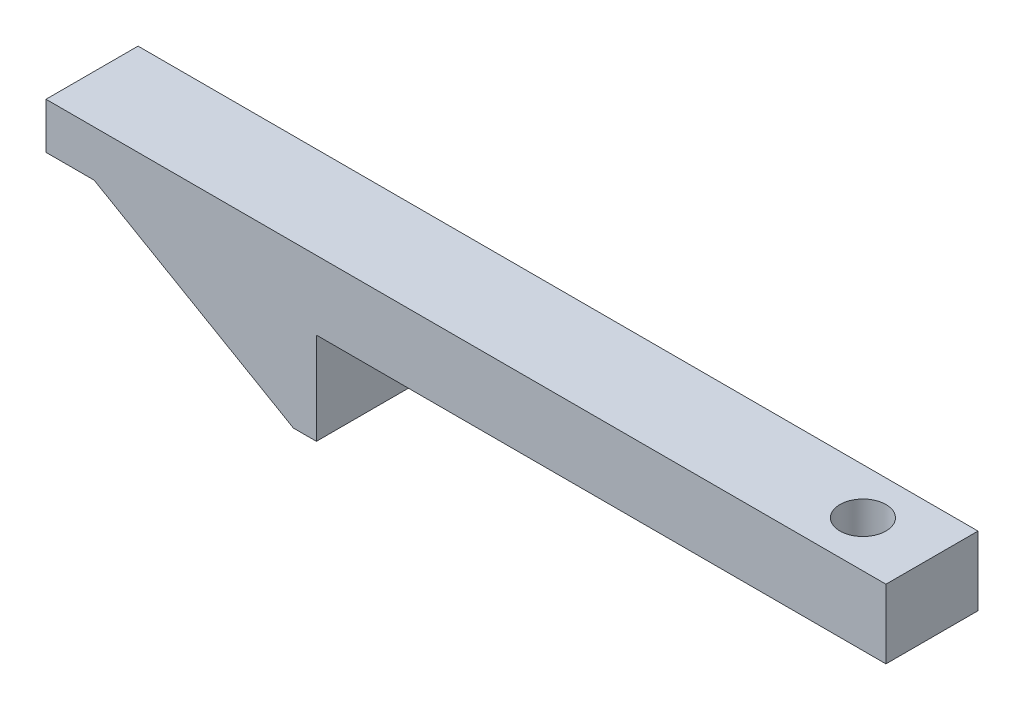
ISO-10303-21;
HEADER;
FILE_DESCRIPTION(('STEP AP214'),'2;1');
FILE_NAME('part.step','',(''),(''),'','','');
FILE_SCHEMA(('AUTOMOTIVE_DESIGN { 1 0 10303 214 1 1 1 1 }'));
ENDSEC;
DATA;
#1=APPLICATION_CONTEXT('core data for automotive mechanical design processes');
#2=APPLICATION_PROTOCOL_DEFINITION('international standard','automotive_design',2000,#1);
#3=PRODUCT_CONTEXT('',#1,'mechanical');
#4=PRODUCT('Part','Part','',(#3));
#5=PRODUCT_RELATED_PRODUCT_CATEGORY('part','',(#4));
#6=PRODUCT_DEFINITION_FORMATION('','',#4);
#7=PRODUCT_DEFINITION_CONTEXT('part definition',#1,'design');
#8=PRODUCT_DEFINITION('design','',#6,#7);
#9=PRODUCT_DEFINITION_SHAPE('','',#8);
#10=(LENGTH_UNIT() NAMED_UNIT(*) SI_UNIT(.MILLI.,.METRE.));
#11=(NAMED_UNIT(*) PLANE_ANGLE_UNIT() SI_UNIT($,.RADIAN.));
#12=(NAMED_UNIT(*) SI_UNIT($,.STERADIAN.) SOLID_ANGLE_UNIT());
#13=UNCERTAINTY_MEASURE_WITH_UNIT(LENGTH_MEASURE(1.E-05),#10,'distance_accuracy_value','');
#14=(GEOMETRIC_REPRESENTATION_CONTEXT(3) GLOBAL_UNCERTAINTY_ASSIGNED_CONTEXT((#13)) GLOBAL_UNIT_ASSIGNED_CONTEXT((#10,
#11,#12)) REPRESENTATION_CONTEXT('',''));
#15=CARTESIAN_POINT('',(0.,0.,0.));
#16=DIRECTION('',(0.,0.,1.));
#17=DIRECTION('',(1.,0.,0.));
#18=AXIS2_PLACEMENT_3D('',#15,#16,#17);
#19=CARTESIAN_POINT('',(-69.0626,-22.225,6.35));
#20=DIRECTION('',(0.,1.,0.));
#21=DIRECTION('',(-1.,0.,0.));
#22=AXIS2_PLACEMENT_3D('',#19,#20,#21);
#23=PLANE('',#22);
#24=DIRECTION('',(1.,0.,0.));
#25=VECTOR('',#24,1.);
#26=CARTESIAN_POINT('',(-69.0626,-22.225,-6.35));
#27=LINE('',#26,#25);
#28=CARTESIAN_POINT('',(-72.2376,-22.225,-6.35));
#29=VERTEX_POINT('',#28);
#30=CARTESIAN_POINT('',(-69.0626,-22.225,-6.35));
#31=VERTEX_POINT('',#30);
#32=EDGE_CURVE('E130',#29,#31,#27,.T.);
#33=ORIENTED_EDGE('',*,*,#32,.T.);
#34=DIRECTION('',(0.,0.,-1.));
#35=VECTOR('',#34,1.);
#36=CARTESIAN_POINT('',(-69.0626,-22.225,6.35));
#37=LINE('',#36,#35);
#38=CARTESIAN_POINT('',(-69.0626,-22.225,6.35));
#39=VERTEX_POINT('',#38);
#40=EDGE_CURVE('E11',#39,#31,#37,.T.);
#41=ORIENTED_EDGE('',*,*,#40,.F.);
#42=DIRECTION('',(1.,0.,0.));
#43=VECTOR('',#42,1.);
#44=CARTESIAN_POINT('',(-69.0626,-22.225,6.35));
#45=LINE('',#44,#43);
#46=CARTESIAN_POINT('',(-72.2376,-22.225,6.35));
#47=VERTEX_POINT('',#46);
#48=EDGE_CURVE('E145',#47,#39,#45,.T.);
#49=ORIENTED_EDGE('',*,*,#48,.F.);
#50=DIRECTION('',(0.,0.,-1.));
#51=VECTOR('',#50,1.);
#52=CARTESIAN_POINT('',(-72.2376,-22.225,6.35));
#53=LINE('',#52,#51);
#54=EDGE_CURVE('E126',#47,#29,#53,.T.);
#55=ORIENTED_EDGE('',*,*,#54,.T.);
#56=EDGE_LOOP('',(#33,#41,#49,#55));
#57=FACE_BOUND('',#56,.T.);
#58=ADVANCED_FACE('F33',(#57),#23,.F.);
#59=CARTESIAN_POINT('',(-69.0626,-9.52500000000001,6.35));
#60=DIRECTION('',(-1.,0.,0.));
#61=DIRECTION('',(0.,0.,1.));
#62=AXIS2_PLACEMENT_3D('',#59,#60,#61);
#63=PLANE('',#62);
#64=DIRECTION('',(0.,1.,0.));
#65=VECTOR('',#64,1.);
#66=CARTESIAN_POINT('',(-69.0626,-9.52500000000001,-6.35));
#67=LINE('',#66,#65);
#68=CARTESIAN_POINT('',(-69.0626,-9.52500000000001,-6.35));
#69=VERTEX_POINT('',#68);
#70=EDGE_CURVE('E133',#31,#69,#67,.T.);
#71=ORIENTED_EDGE('',*,*,#70,.T.);
#72=DIRECTION('',(0.,0.,-1.));
#73=VECTOR('',#72,1.);
#74=CARTESIAN_POINT('',(-69.0626,-9.52500000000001,6.35));
#75=LINE('',#74,#73);
#76=CARTESIAN_POINT('',(-69.0626,-9.52500000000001,6.35));
#77=VERTEX_POINT('',#76);
#78=EDGE_CURVE('E42',#77,#69,#75,.T.);
#79=ORIENTED_EDGE('',*,*,#78,.F.);
#80=DIRECTION('',(0.,1.,0.));
#81=VECTOR('',#80,1.);
#82=CARTESIAN_POINT('',(-69.0626,-9.52500000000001,6.35));
#83=LINE('',#82,#81);
#84=EDGE_CURVE('E93',#39,#77,#83,.T.);
#85=ORIENTED_EDGE('',*,*,#84,.F.);
#86=ORIENTED_EDGE('',*,*,#40,.T.);
#87=EDGE_LOOP('',(#71,#79,#85,#86));
#88=FACE_BOUND('',#87,.T.);
#89=ADVANCED_FACE('F195',(#88),#63,.F.);
#90=CARTESIAN_POINT('',(9.525,-9.525,6.35));
#91=DIRECTION('',(0.,1.,0.));
#92=DIRECTION('',(-1.,0.,0.));
#93=AXIS2_PLACEMENT_3D('',#90,#91,#92);
#94=PLANE('',#93);
#95=CARTESIAN_POINT('',(0.,-9.525,0.));
#96=DIRECTION('',(0.,-1.,0.));
#97=DIRECTION('',(0.,0.,-1.));
#98=AXIS2_PLACEMENT_3D('',#95,#96,#97);
#99=CIRCLE('',#98,3.175);
#100=CARTESIAN_POINT('',(0.,-9.525,-3.175));
#101=VERTEX_POINT('',#100);
#102=EDGE_CURVE('E178',#101,#101,#99,.T.);
#103=ORIENTED_EDGE('',*,*,#102,.F.);
#104=EDGE_LOOP('',(#103));
#105=FACE_BOUND('',#104,.T.);
#106=DIRECTION('',(1.,0.,0.));
#107=VECTOR('',#106,1.);
#108=CARTESIAN_POINT('',(9.525,-9.525,-6.35));
#109=LINE('',#108,#107);
#110=CARTESIAN_POINT('',(9.525,-9.525,-6.35));
#111=VERTEX_POINT('',#110);
#112=EDGE_CURVE('E135',#69,#111,#109,.T.);
#113=ORIENTED_EDGE('',*,*,#112,.T.);
#114=DIRECTION('',(0.,0.,-1.));
#115=VECTOR('',#114,1.);
#116=CARTESIAN_POINT('',(9.525,-9.525,6.35));
#117=LINE('',#116,#115);
#118=CARTESIAN_POINT('',(9.525,-9.525,6.35));
#119=VERTEX_POINT('',#118);
#120=EDGE_CURVE('E152',#119,#111,#117,.T.);
#121=ORIENTED_EDGE('',*,*,#120,.F.);
#122=DIRECTION('',(1.,0.,0.));
#123=VECTOR('',#122,1.);
#124=CARTESIAN_POINT('',(9.525,-9.525,6.35));
#125=LINE('',#124,#123);
#126=EDGE_CURVE('E161',#77,#119,#125,.T.);
#127=ORIENTED_EDGE('',*,*,#126,.F.);
#128=ORIENTED_EDGE('',*,*,#78,.T.);
#129=EDGE_LOOP('',(#113,#121,#127,#128));
#130=FACE_BOUND('',#129,.T.);
#131=ADVANCED_FACE('F159',(#105,#130),#94,.F.);
#132=CARTESIAN_POINT('',(9.525,0.,6.35));
#133=DIRECTION('',(-1.,0.,0.));
#134=DIRECTION('',(0.,-1.,0.));
#135=AXIS2_PLACEMENT_3D('',#132,#133,#134);
#136=PLANE('',#135);
#137=DIRECTION('',(0.,1.,0.));
#138=VECTOR('',#137,1.);
#139=CARTESIAN_POINT('',(9.525,0.,-6.35));
#140=LINE('',#139,#138);
#141=CARTESIAN_POINT('',(9.525,0.,-6.35));
#142=VERTEX_POINT('',#141);
#143=EDGE_CURVE('E137',#111,#142,#140,.T.);
#144=ORIENTED_EDGE('',*,*,#143,.T.);
#145=DIRECTION('',(0.,0.,-1.));
#146=VECTOR('',#145,1.);
#147=CARTESIAN_POINT('',(9.525,0.,6.35));
#148=LINE('',#147,#146);
#149=CARTESIAN_POINT('',(9.525,0.,6.35));
#150=VERTEX_POINT('',#149);
#151=EDGE_CURVE('E149',#150,#142,#148,.T.);
#152=ORIENTED_EDGE('',*,*,#151,.F.);
#153=DIRECTION('',(0.,1.,0.));
#154=VECTOR('',#153,1.);
#155=CARTESIAN_POINT('',(9.525,0.,6.35));
#156=LINE('',#155,#154);
#157=EDGE_CURVE('E172',#119,#150,#156,.T.);
#158=ORIENTED_EDGE('',*,*,#157,.F.);
#159=ORIENTED_EDGE('',*,*,#120,.T.);
#160=EDGE_LOOP('',(#144,#152,#158,#159));
#161=FACE_BOUND('',#160,.T.);
#162=ADVANCED_FACE('F168',(#161),#136,.F.);
#163=CARTESIAN_POINT('',(-106.3752,0.,6.35));
#164=DIRECTION('',(0.,-1.,0.));
#165=DIRECTION('',(0.,0.,-1.));
#166=AXIS2_PLACEMENT_3D('',#163,#164,#165);
#167=PLANE('',#166);
#168=CARTESIAN_POINT('',(0.,0.,0.));
#169=DIRECTION('',(0.,-1.,0.));
#170=DIRECTION('',(0.,0.,-1.));
#171=AXIS2_PLACEMENT_3D('',#168,#169,#170);
#172=CIRCLE('',#171,3.175);
#173=CARTESIAN_POINT('',(0.,0.,-3.175));
#174=VERTEX_POINT('',#173);
#175=EDGE_CURVE('E36',#174,#174,#172,.T.);
#176=ORIENTED_EDGE('',*,*,#175,.T.);
#177=EDGE_LOOP('',(#176));
#178=FACE_BOUND('',#177,.T.);
#179=DIRECTION('',(-1.,0.,0.));
#180=VECTOR('',#179,1.);
#181=CARTESIAN_POINT('',(-106.3752,0.,-6.35));
#182=LINE('',#181,#180);
#183=CARTESIAN_POINT('',(-106.3752,0.,-6.35));
#184=VERTEX_POINT('',#183);
#185=EDGE_CURVE('E140',#142,#184,#182,.T.);
#186=ORIENTED_EDGE('',*,*,#185,.T.);
#187=DIRECTION('',(0.,0.,-1.));
#188=VECTOR('',#187,1.);
#189=CARTESIAN_POINT('',(-106.3752,0.,6.35));
#190=LINE('',#189,#188);
#191=CARTESIAN_POINT('',(-106.3752,0.,6.35));
#192=VERTEX_POINT('',#191);
#193=EDGE_CURVE('E121',#192,#184,#190,.T.);
#194=ORIENTED_EDGE('',*,*,#193,.F.);
#195=DIRECTION('',(-1.,0.,0.));
#196=VECTOR('',#195,1.);
#197=CARTESIAN_POINT('',(0.,0.,6.35));
#198=LINE('',#197,#196);
#199=EDGE_CURVE('E112',#150,#192,#198,.T.);
#200=ORIENTED_EDGE('',*,*,#199,.F.);
#201=ORIENTED_EDGE('',*,*,#151,.T.);
#202=EDGE_LOOP('',(#186,#194,#200,#201));
#203=FACE_BOUND('',#202,.T.);
#204=ADVANCED_FACE('F171',(#178,#203),#167,.F.);
#205=CARTESIAN_POINT('',(-106.3752,-6.35,6.35));
#206=DIRECTION('',(1.,0.,0.));
#207=DIRECTION('',(0.,0.,-1.));
#208=AXIS2_PLACEMENT_3D('',#205,#206,#207);
#209=PLANE('',#208);
#210=DIRECTION('',(0.,-1.,0.));
#211=VECTOR('',#210,1.);
#212=CARTESIAN_POINT('',(-106.3752,-6.35,-6.35));
#213=LINE('',#212,#211);
#214=CARTESIAN_POINT('',(-106.3752,-6.35,-6.35));
#215=VERTEX_POINT('',#214);
#216=EDGE_CURVE('E120',#184,#215,#213,.T.);
#217=ORIENTED_EDGE('',*,*,#216,.T.);
#218=DIRECTION('',(0.,0.,-1.));
#219=VECTOR('',#218,1.);
#220=CARTESIAN_POINT('',(-106.3752,-6.35,6.35));
#221=LINE('',#220,#219);
#222=CARTESIAN_POINT('',(-106.3752,-6.35,6.35));
#223=VERTEX_POINT('',#222);
#224=EDGE_CURVE('E117',#223,#215,#221,.T.);
#225=ORIENTED_EDGE('',*,*,#224,.F.);
#226=DIRECTION('',(0.,-1.,0.));
#227=VECTOR('',#226,1.);
#228=CARTESIAN_POINT('',(-106.3752,-6.35,6.35));
#229=LINE('',#228,#227);
#230=EDGE_CURVE('E106',#192,#223,#229,.T.);
#231=ORIENTED_EDGE('',*,*,#230,.F.);
#232=ORIENTED_EDGE('',*,*,#193,.T.);
#233=EDGE_LOOP('',(#217,#225,#231,#232));
#234=FACE_BOUND('',#233,.T.);
#235=ADVANCED_FACE('F118',(#234),#209,.F.);
#236=CARTESIAN_POINT('',(-99.7339065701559,-6.35,6.35));
#237=DIRECTION('',(0.,1.,0.));
#238=DIRECTION('',(-1.,0.,0.));
#239=AXIS2_PLACEMENT_3D('',#236,#237,#238);
#240=PLANE('',#239);
#241=DIRECTION('',(1.,0.,0.));
#242=VECTOR('',#241,1.);
#243=CARTESIAN_POINT('',(-99.7339065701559,-6.35,-6.35));
#244=LINE('',#243,#242);
#245=CARTESIAN_POINT('',(-99.7339065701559,-6.35,-6.35));
#246=VERTEX_POINT('',#245);
#247=EDGE_CURVE('E79',#215,#246,#244,.T.);
#248=ORIENTED_EDGE('',*,*,#247,.T.);
#249=DIRECTION('',(0.,0.,-1.));
#250=VECTOR('',#249,1.);
#251=CARTESIAN_POINT('',(-99.7339065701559,-6.35,6.35));
#252=LINE('',#251,#250);
#253=CARTESIAN_POINT('',(-99.7339065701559,-6.35,6.35));
#254=VERTEX_POINT('',#253);
#255=EDGE_CURVE('E122',#254,#246,#252,.T.);
#256=ORIENTED_EDGE('',*,*,#255,.F.);
#257=DIRECTION('',(1.,0.,0.));
#258=VECTOR('',#257,1.);
#259=CARTESIAN_POINT('',(-99.7339065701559,-6.35,6.35));
#260=LINE('',#259,#258);
#261=EDGE_CURVE('E110',#223,#254,#260,.T.);
#262=ORIENTED_EDGE('',*,*,#261,.F.);
#263=ORIENTED_EDGE('',*,*,#224,.T.);
#264=EDGE_LOOP('',(#248,#256,#262,#263));
#265=FACE_BOUND('',#264,.T.);
#266=ADVANCED_FACE('F124',(#265),#240,.F.);
#267=CARTESIAN_POINT('',(-72.2376,-22.225,6.35));
#268=DIRECTION('',(0.500000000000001,0.866025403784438,0.));
#269=DIRECTION('',(-0.866025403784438,0.500000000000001,0.));
#270=AXIS2_PLACEMENT_3D('',#267,#268,#269);
#271=PLANE('',#270);
#272=DIRECTION('',(0.866025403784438,-0.500000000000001,0.));
#273=VECTOR('',#272,1.);
#274=CARTESIAN_POINT('',(-72.2376,-22.225,-6.35));
#275=LINE('',#274,#273);
#276=EDGE_CURVE('E85',#246,#29,#275,.T.);
#277=ORIENTED_EDGE('',*,*,#276,.T.);
#278=ORIENTED_EDGE('',*,*,#54,.F.);
#279=DIRECTION('',(0.866025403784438,-0.500000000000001,0.));
#280=VECTOR('',#279,1.);
#281=CARTESIAN_POINT('',(-72.2376,-22.225,6.35));
#282=LINE('',#281,#280);
#283=EDGE_CURVE('E50',#254,#47,#282,.T.);
#284=ORIENTED_EDGE('',*,*,#283,.F.);
#285=ORIENTED_EDGE('',*,*,#255,.T.);
#286=EDGE_LOOP('',(#277,#278,#284,#285));
#287=FACE_BOUND('',#286,.T.);
#288=ADVANCED_FACE('F202',(#287),#271,.F.);
#289=CARTESIAN_POINT('',(0.,0.,6.35));
#290=DIRECTION('',(0.,0.,-1.));
#291=DIRECTION('',(-1.,0.,0.));
#292=AXIS2_PLACEMENT_3D('',#289,#290,#291);
#293=PLANE('',#292);
#294=ORIENTED_EDGE('',*,*,#48,.T.);
#295=ORIENTED_EDGE('',*,*,#84,.T.);
#296=ORIENTED_EDGE('',*,*,#126,.T.);
#297=ORIENTED_EDGE('',*,*,#157,.T.);
#298=ORIENTED_EDGE('',*,*,#199,.T.);
#299=ORIENTED_EDGE('',*,*,#230,.T.);
#300=ORIENTED_EDGE('',*,*,#261,.T.);
#301=ORIENTED_EDGE('',*,*,#283,.T.);
#302=EDGE_LOOP('',(#294,#295,#296,#297,#298,#299,#300,#301));
#303=FACE_BOUND('',#302,.T.);
#304=ADVANCED_FACE('F108',(#303),#293,.F.);
#305=CARTESIAN_POINT('',(0.,0.,-6.35));
#306=DIRECTION('',(0.,0.,-1.));
#307=DIRECTION('',(-1.,0.,0.));
#308=AXIS2_PLACEMENT_3D('',#305,#306,#307);
#309=PLANE('',#308);
#310=ORIENTED_EDGE('',*,*,#32,.F.);
#311=ORIENTED_EDGE('',*,*,#276,.F.);
#312=ORIENTED_EDGE('',*,*,#247,.F.);
#313=ORIENTED_EDGE('',*,*,#216,.F.);
#314=ORIENTED_EDGE('',*,*,#185,.F.);
#315=ORIENTED_EDGE('',*,*,#143,.F.);
#316=ORIENTED_EDGE('',*,*,#112,.F.);
#317=ORIENTED_EDGE('',*,*,#70,.F.);
#318=EDGE_LOOP('',(#310,#311,#312,#313,#314,#315,#316,#317));
#319=FACE_BOUND('',#318,.T.);
#320=ADVANCED_FACE('F165',(#319),#309,.T.);
#321=CARTESIAN_POINT('',(0.,-9.525,0.));
#322=DIRECTION('',(0.,-1.,0.));
#323=DIRECTION('',(0.,0.,-1.));
#324=AXIS2_PLACEMENT_3D('',#321,#322,#323);
#325=CYLINDRICAL_SURFACE('',#324,3.175);
#326=ORIENTED_EDGE('',*,*,#102,.T.);
#327=EDGE_LOOP('',(#326));
#328=FACE_BOUND('',#327,.T.);
#329=ORIENTED_EDGE('',*,*,#175,.F.);
#330=EDGE_LOOP('',(#329));
#331=FACE_BOUND('',#330,.T.);
#332=ADVANCED_FACE('F186',(#328,#331),#325,.F.);
#333=CLOSED_SHELL('',(#58,#89,#131,#162,#204,#235,#266,#288,#304,#320,#332));
#334=MANIFOLD_SOLID_BREP('B2',#333);
#335=ADVANCED_BREP_SHAPE_REPRESENTATION('',(#18,#334),#14);
#336=SHAPE_DEFINITION_REPRESENTATION(#9,#335);
ENDSEC;
END-ISO-10303-21;
